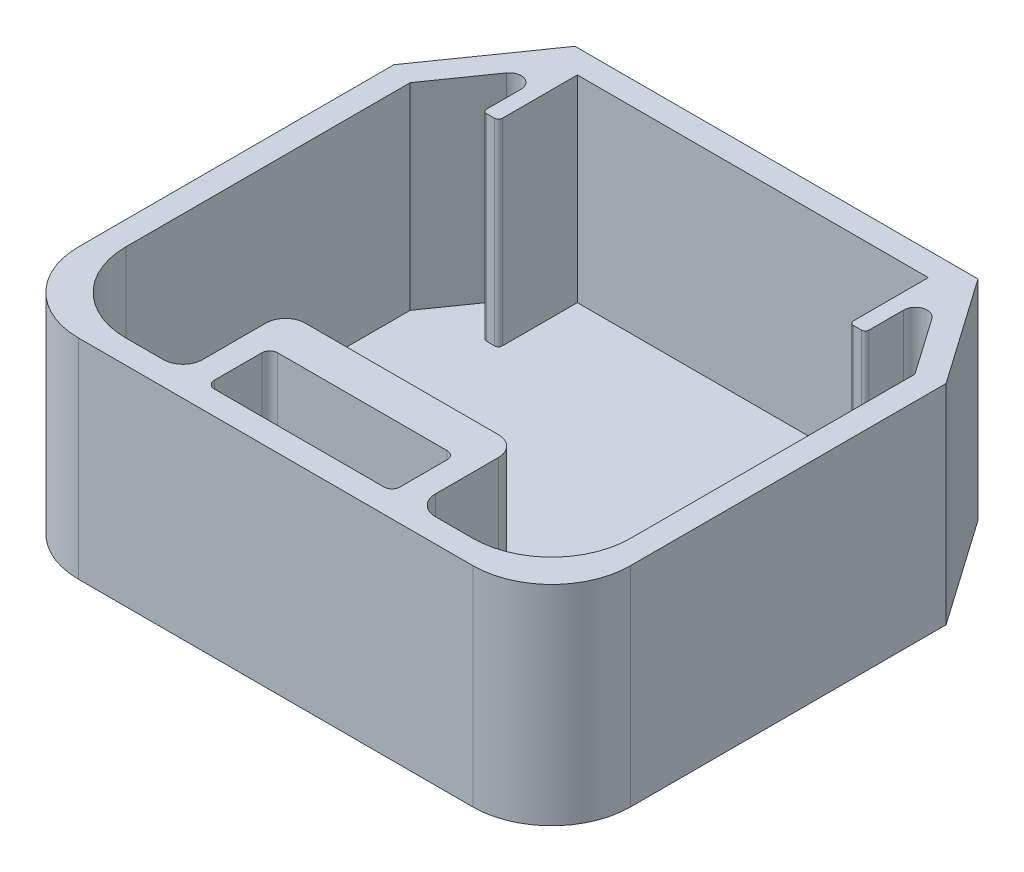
from build123d import *

# Parameters (mm, degrees)
EXTRUDE_1_DEPTH = 0.3
EXTRUDE_2_DEPTH = 5
FILLET_2_R      = 2
EXTRUDE_4_DEPTH = 5
FILLET_3_R      = 0.5
FILLET_4_R      = 0.2
SKETCH_5_W      = 0.4
SKETCH_5_H      = 2
EXTRUDE_5_DEPTH = 5
FILLET_5_R      = 0.3
FILLET_7_R      = 0.1


with BuildPart() as part:
    # Sketch 1 → Extrude 1 (new body)
    with BuildSketch(Plane(origin=(0, 0, 0), x_dir=(1, 0, 0), z_dir=(0, 1, 0))):
        Polygon((5.109439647, 6.35), (7, 3.65), (7, -6.35), (-7, -6.35), (-7, 3.65), (-5.109439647, 6.35), align=None)
    extrude(amount=EXTRUDE_1_DEPTH)

    # Sketch 2 → Extrude 2 (add)
    with BuildSketch(Plane(origin=(0, 0.3, 0), x_dir=(1, 0, 0), z_dir=(0, 1, 0))):
        Polygon((-5.109439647, 6.35), (-7, 3.65), (-7, -6.35), (7, -6.35), (7, 3.65), (5.109439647, 6.35), align=None)
        Polygon((-4.797099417, 5.75), (-6.4, 3.460820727), (-6.4, -5.75), (6.4, -5.75), (6.4, 3.460820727), (4.797099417, 5.75), align=None, mode=Mode.SUBTRACT)
    extrude(amount=EXTRUDE_2_DEPTH)

    # Fillet 2
    fillet_2_edges = [part.edges().sort_by_distance(p)[0] for p in [
        (7, 2.65, 6.35),
        (-7, 2.65, 6.35),
        (-6.4, 2.8, 5.75),
        (6.4, 2.8, 5.75),
    ]]
    fillet(fillet_2_edges, radius=FILLET_2_R)

    # Sketch 4 → Extrude 4 (add)
    with BuildSketch(Plane(origin=(0, 5.3, 0), x_dir=(1, 0, 0), z_dir=(0, 1, 0))):
        Polygon((-2.35, -5.75), (-2.35, -4.15), (2.35, -4.15), (2.35, -5.75), (2.95, -5.75), (2.95, -3.15), (-2.95, -3.15), (-2.95, -5.75), align=None)
    extrude(amount=-EXTRUDE_4_DEPTH)

    # Fillet 3
    fillet_3_edges = [part.edges().sort_by_distance(p)[0] for p in [
        (-2.95, 2.8, 5.75),
        (-2.95, 2.8, 3.15),
        (2.95, 2.8, 3.15),
        (2.95, 2.8, 5.75),
    ]]
    fillet(fillet_3_edges, radius=FILLET_3_R)

    # Fillet 4
    fillet_4_edges = [part.edges().sort_by_distance(p)[0] for p in [
        (-2.35, 2.8, 5.75),
        (2.35, 2.8, 5.75),
        (2.35, 2.8, 4.15),
        (-2.35, 2.8, 4.15),
    ]]
    fillet(fillet_4_edges, radius=FILLET_4_R)

    # Sketch 5 → Extrude 5 (add)
    with BuildSketch(Plane(origin=(0, 0.3, 0), x_dir=(1, 0, 0), z_dir=(0, 1, 0))):
        with Locations((-4.65, 4.75)):
            Rectangle(SKETCH_5_W, SKETCH_5_H)
        with Locations((4.65, 4.75)):
            Rectangle(SKETCH_5_W, SKETCH_5_H)
    extrude(amount=EXTRUDE_5_DEPTH)

    # Fillet 5
    fillet_5_edges = [part.edges().sort_by_distance(p)[0] for p in [
        (-4.85, 2.8, -5.674450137),
        (4.85, 2.8, -5.674450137),
    ]]
    fillet(fillet_5_edges, radius=FILLET_5_R)

    # Fillet 7
    fillet_7_edges = [part.edges().sort_by_distance(p)[0] for p in [
        (-4.85, 2.8, -3.75),
        (-4.45, 2.8, -3.75),
        (4.45, 2.8, -3.75),
        (4.85, 2.8, -3.75),
    ]]
    fillet(fillet_7_edges, radius=FILLET_7_R)


solid = part.part
